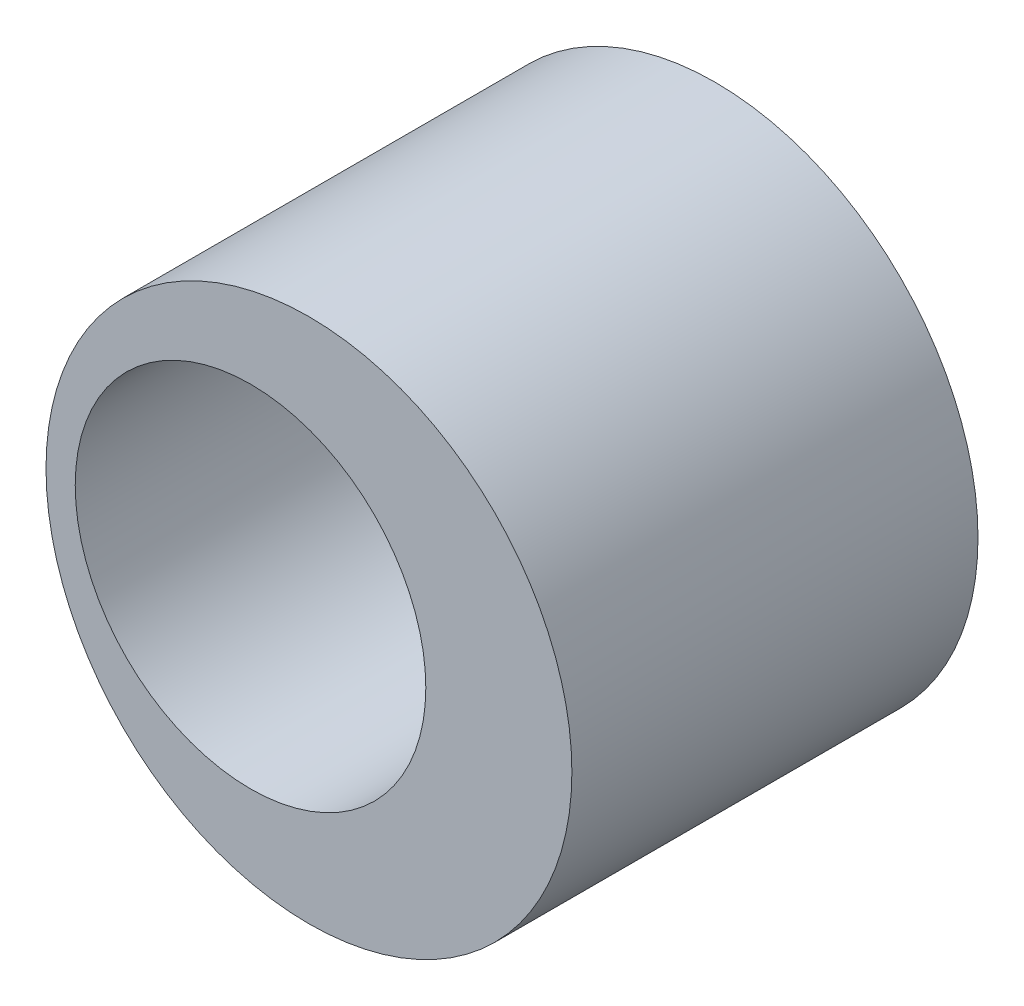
ISO-10303-21;
HEADER;
FILE_DESCRIPTION(('STEP AP214'),'2;1');
FILE_NAME('part.step','',(''),(''),'','','');
FILE_SCHEMA(('AUTOMOTIVE_DESIGN { 1 0 10303 214 1 1 1 1 }'));
ENDSEC;
DATA;
#1=APPLICATION_CONTEXT('core data for automotive mechanical design processes');
#2=APPLICATION_PROTOCOL_DEFINITION('international standard','automotive_design',2000,#1);
#3=PRODUCT_CONTEXT('',#1,'mechanical');
#4=PRODUCT('Part','Part','',(#3));
#5=PRODUCT_RELATED_PRODUCT_CATEGORY('part','',(#4));
#6=PRODUCT_DEFINITION_FORMATION('','',#4);
#7=PRODUCT_DEFINITION_CONTEXT('part definition',#1,'design');
#8=PRODUCT_DEFINITION('design','',#6,#7);
#9=PRODUCT_DEFINITION_SHAPE('','',#8);
#10=(LENGTH_UNIT() NAMED_UNIT(*) SI_UNIT(.MILLI.,.METRE.));
#11=(NAMED_UNIT(*) PLANE_ANGLE_UNIT() SI_UNIT($,.RADIAN.));
#12=(NAMED_UNIT(*) SI_UNIT($,.STERADIAN.) SOLID_ANGLE_UNIT());
#13=UNCERTAINTY_MEASURE_WITH_UNIT(LENGTH_MEASURE(1.E-05),#10,'distance_accuracy_value','');
#14=(GEOMETRIC_REPRESENTATION_CONTEXT(3) GLOBAL_UNCERTAINTY_ASSIGNED_CONTEXT((#13)) GLOBAL_UNIT_ASSIGNED_CONTEXT((#10,
#11,#12)) REPRESENTATION_CONTEXT('',''));
#15=CARTESIAN_POINT('',(0.,0.,0.));
#16=DIRECTION('',(0.,0.,1.));
#17=DIRECTION('',(1.,0.,0.));
#18=AXIS2_PLACEMENT_3D('',#15,#16,#17);
#19=CARTESIAN_POINT('',(0.,0.,13.9));
#20=DIRECTION('',(0.,0.,1.));
#21=DIRECTION('',(1.,0.,0.));
#22=AXIS2_PLACEMENT_3D('',#19,#20,#21);
#23=PLANE('',#22);
#24=CARTESIAN_POINT('',(0.,0.,13.9));
#25=DIRECTION('',(0.,0.,1.));
#26=DIRECTION('',(1.,0.,0.));
#27=AXIS2_PLACEMENT_3D('',#24,#25,#26);
#28=CIRCLE('',#27,9.);
#29=CARTESIAN_POINT('',(9.,0.,13.9));
#30=VERTEX_POINT('',#29);
#31=EDGE_CURVE('E8',#30,#30,#28,.T.);
#32=ORIENTED_EDGE('',*,*,#31,.T.);
#33=EDGE_LOOP('',(#32));
#34=FACE_BOUND('',#33,.T.);
#35=CARTESIAN_POINT('',(-2.,0.,13.9));
#36=DIRECTION('',(0.,0.,1.));
#37=DIRECTION('',(1.,0.,0.));
#38=AXIS2_PLACEMENT_3D('',#35,#36,#37);
#39=CIRCLE('',#38,6.);
#40=CARTESIAN_POINT('',(4.,0.,13.9));
#41=VERTEX_POINT('',#40);
#42=EDGE_CURVE('E23',#41,#41,#39,.T.);
#43=ORIENTED_EDGE('',*,*,#42,.F.);
#44=EDGE_LOOP('',(#43));
#45=FACE_BOUND('',#44,.T.);
#46=ADVANCED_FACE('F12',(#34,#45),#23,.T.);
#47=CARTESIAN_POINT('',(0.,0.,0.));
#48=DIRECTION('',(0.,0.,1.));
#49=DIRECTION('',(1.,0.,0.));
#50=AXIS2_PLACEMENT_3D('',#47,#48,#49);
#51=PLANE('',#50);
#52=CARTESIAN_POINT('',(0.,0.,0.));
#53=DIRECTION('',(0.,0.,1.));
#54=DIRECTION('',(1.,0.,0.));
#55=AXIS2_PLACEMENT_3D('',#52,#53,#54);
#56=CIRCLE('',#55,9.);
#57=CARTESIAN_POINT('',(9.,0.,0.));
#58=VERTEX_POINT('',#57);
#59=EDGE_CURVE('E19',#58,#58,#56,.T.);
#60=ORIENTED_EDGE('',*,*,#59,.F.);
#61=EDGE_LOOP('',(#60));
#62=FACE_BOUND('',#61,.T.);
#63=CARTESIAN_POINT('',(-2.,0.,0.));
#64=DIRECTION('',(0.,0.,1.));
#65=DIRECTION('',(1.,0.,0.));
#66=AXIS2_PLACEMENT_3D('',#63,#64,#65);
#67=CIRCLE('',#66,6.);
#68=CARTESIAN_POINT('',(4.,0.,0.));
#69=VERTEX_POINT('',#68);
#70=EDGE_CURVE('E27',#69,#69,#67,.T.);
#71=ORIENTED_EDGE('',*,*,#70,.T.);
#72=EDGE_LOOP('',(#71));
#73=FACE_BOUND('',#72,.T.);
#74=ADVANCED_FACE('F33',(#62,#73),#51,.F.);
#75=CARTESIAN_POINT('',(0.,0.,13.9));
#76=DIRECTION('',(0.,0.,-1.));
#77=DIRECTION('',(-1.,0.,0.));
#78=AXIS2_PLACEMENT_3D('',#75,#76,#77);
#79=CYLINDRICAL_SURFACE('',#78,9.);
#80=ORIENTED_EDGE('',*,*,#31,.F.);
#81=EDGE_LOOP('',(#80));
#82=FACE_BOUND('',#81,.T.);
#83=ORIENTED_EDGE('',*,*,#59,.T.);
#84=EDGE_LOOP('',(#83));
#85=FACE_BOUND('',#84,.T.);
#86=ADVANCED_FACE('F14',(#82,#85),#79,.T.);
#87=CARTESIAN_POINT('',(-2.,0.,13.9));
#88=DIRECTION('',(0.,0.,-1.));
#89=DIRECTION('',(-1.,0.,0.));
#90=AXIS2_PLACEMENT_3D('',#87,#88,#89);
#91=CYLINDRICAL_SURFACE('',#90,6.);
#92=ORIENTED_EDGE('',*,*,#42,.T.);
#93=EDGE_LOOP('',(#92));
#94=FACE_BOUND('',#93,.T.);
#95=ORIENTED_EDGE('',*,*,#70,.F.);
#96=EDGE_LOOP('',(#95));
#97=FACE_BOUND('',#96,.T.);
#98=ADVANCED_FACE('F35',(#94,#97),#91,.F.);
#99=CLOSED_SHELL('',(#46,#74,#86,#98));
#100=MANIFOLD_SOLID_BREP('B1',#99);
#101=ADVANCED_BREP_SHAPE_REPRESENTATION('',(#18,#100),#14);
#102=SHAPE_DEFINITION_REPRESENTATION(#9,#101);
ENDSEC;
END-ISO-10303-21;
